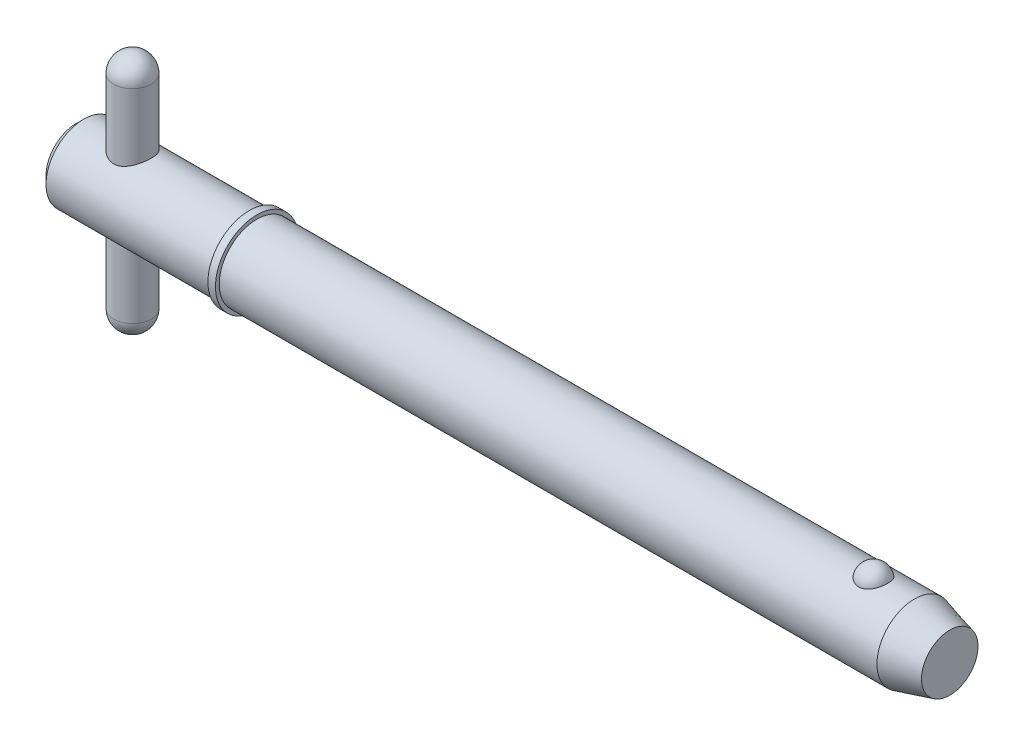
ISO-10303-21;
HEADER;
FILE_DESCRIPTION(('STEP AP214'),'2;1');
FILE_NAME('part.step','',(''),(''),'','','');
FILE_SCHEMA(('AUTOMOTIVE_DESIGN { 1 0 10303 214 1 1 1 1 }'));
ENDSEC;
DATA;
#1=APPLICATION_CONTEXT('core data for automotive mechanical design processes');
#2=APPLICATION_PROTOCOL_DEFINITION('international standard','automotive_design',2000,#1);
#3=PRODUCT_CONTEXT('',#1,'mechanical');
#4=PRODUCT('Part','Part','',(#3));
#5=PRODUCT_RELATED_PRODUCT_CATEGORY('part','',(#4));
#6=PRODUCT_DEFINITION_FORMATION('','',#4);
#7=PRODUCT_DEFINITION_CONTEXT('part definition',#1,'design');
#8=PRODUCT_DEFINITION('design','',#6,#7);
#9=PRODUCT_DEFINITION_SHAPE('','',#8);
#10=(LENGTH_UNIT() NAMED_UNIT(*) SI_UNIT(.MILLI.,.METRE.));
#11=(NAMED_UNIT(*) PLANE_ANGLE_UNIT() SI_UNIT($,.RADIAN.));
#12=(NAMED_UNIT(*) SI_UNIT($,.STERADIAN.) SOLID_ANGLE_UNIT());
#13=UNCERTAINTY_MEASURE_WITH_UNIT(LENGTH_MEASURE(1.E-05),#10,'distance_accuracy_value','');
#14=(GEOMETRIC_REPRESENTATION_CONTEXT(3) GLOBAL_UNCERTAINTY_ASSIGNED_CONTEXT((#13)) GLOBAL_UNIT_ASSIGNED_CONTEXT((#10,
#11,#12)) REPRESENTATION_CONTEXT('',''));
#15=CARTESIAN_POINT('',(0.,0.,0.));
#16=DIRECTION('',(0.,0.,1.));
#17=DIRECTION('',(1.,0.,0.));
#18=AXIS2_PLACEMENT_3D('',#15,#16,#17);
#19=CARTESIAN_POINT('',(5.94,12.7,0.));
#20=DIRECTION('',(0.,-1.,0.));
#21=DIRECTION('',(0.,0.,-1.));
#22=AXIS2_PLACEMENT_3D('',#19,#20,#21);
#23=CYLINDRICAL_SURFACE('',#22,1.98);
#24=CARTESIAN_POINT('',(5.94,-10.72,0.));
#25=DIRECTION('',(0.,-1.,0.));
#26=DIRECTION('',(0.,0.,-1.));
#27=AXIS2_PLACEMENT_3D('',#24,#25,#26);
#28=CIRCLE('',#27,1.98);
#29=CARTESIAN_POINT('',(5.94,-10.72,-1.98));
#30=VERTEX_POINT('',#29);
#31=EDGE_CURVE('P0_E10',#30,#30,#28,.F.);
#32=ORIENTED_EDGE('',*,*,#31,.T.);
#33=EDGE_LOOP('',(#32));
#34=FACE_BOUND('',#33,.T.);
#35=CARTESIAN_POINT('',(5.94,10.72,0.));
#36=DIRECTION('',(0.,-1.,0.));
#37=DIRECTION('',(0.,0.,-1.));
#38=AXIS2_PLACEMENT_3D('',#35,#36,#37);
#39=CIRCLE('',#38,1.98);
#40=CARTESIAN_POINT('',(5.94,10.72,-1.98));
#41=VERTEX_POINT('',#40);
#42=EDGE_CURVE('P0_E21',#41,#41,#39,.T.);
#43=ORIENTED_EDGE('',*,*,#42,.T.);
#44=EDGE_LOOP('',(#43));
#45=FACE_BOUND('',#44,.T.);
#46=ADVANCED_FACE('P0_F14',(#34,#45),#23,.T.);
#47=CARTESIAN_POINT('',(5.94,-10.72,0.));
#48=DIRECTION('',(0.,0.,1.));
#49=DIRECTION('',(1.,0.,0.));
#50=AXIS2_PLACEMENT_3D('',#47,#48,#49);
#51=SPHERICAL_SURFACE('',#50,1.98);
#52=CARTESIAN_POINT('',(5.94,-10.72,0.));
#53=DIRECTION('',(0.,-1.,0.));
#54=DIRECTION('',(0.,0.,-1.));
#55=AXIS2_PLACEMENT_3D('',#52,#53,#54);
#56=SPHERICAL_SURFACE('',#55,1.98);
#57=ORIENTED_EDGE('',*,*,#31,.F.);
#58=EDGE_LOOP('',(#57));
#59=FACE_BOUND('',#58,.T.);
#60=ADVANCED_FACE('P0_F29',(#59),#56,.T.);
#61=CARTESIAN_POINT('',(5.94,10.72,0.));
#62=DIRECTION('',(0.,0.,1.));
#63=DIRECTION('',(1.,0.,0.));
#64=AXIS2_PLACEMENT_3D('',#61,#62,#63);
#65=SPHERICAL_SURFACE('',#64,1.98);
#66=CARTESIAN_POINT('',(5.94,10.72,0.));
#67=DIRECTION('',(0.,-1.,0.));
#68=DIRECTION('',(0.,0.,-1.));
#69=AXIS2_PLACEMENT_3D('',#66,#67,#68);
#70=SPHERICAL_SURFACE('',#69,1.98);
#71=ORIENTED_EDGE('',*,*,#42,.F.);
#72=EDGE_LOOP('',(#71));
#73=FACE_BOUND('',#72,.T.);
#74=ADVANCED_FACE('P0_F16',(#73),#70,.T.);
#75=CLOSED_SHELL('',(#46,#60,#74));
#76=MANIFOLD_SOLID_BREP('P0_B1',#75);
#77=CARTESIAN_POINT('',(0.,0.,0.));
#78=DIRECTION('',(1.,0.,0.));
#79=DIRECTION('',(0.,0.,-1.));
#80=AXIS2_PLACEMENT_3D('',#77,#78,#79);
#81=CYLINDRICAL_SURFACE('',#80,3.97);
#82=CARTESIAN_POINT('',(88.3759395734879,0.,0.));
#83=DIRECTION('',(1.,0.,0.));
#84=DIRECTION('',(0.,0.,-1.));
#85=AXIS2_PLACEMENT_3D('',#82,#83,#84);
#86=CIRCLE('',#85,3.97);
#87=CARTESIAN_POINT('',(88.3759395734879,0.,-3.97));
#88=VERTEX_POINT('',#87);
#89=EDGE_CURVE('P1_E81',#88,#88,#86,.T.);
#90=ORIENTED_EDGE('',*,*,#89,.F.);
#91=EDGE_LOOP('',(#90));
#92=FACE_BOUND('',#91,.T.);
#93=CARTESIAN_POINT('',(19.05,0.,0.));
#94=DIRECTION('',(1.,0.,0.));
#95=DIRECTION('',(0.,0.,-1.));
#96=AXIS2_PLACEMENT_3D('',#93,#94,#95);
#97=CIRCLE('',#96,3.97);
#98=CARTESIAN_POINT('',(19.05,0.,-3.97));
#99=VERTEX_POINT('',#98);
#100=EDGE_CURVE('P1_E85',#99,#99,#97,.T.);
#101=ORIENTED_EDGE('',*,*,#100,.T.);
#102=EDGE_LOOP('',(#101));
#103=FACE_BOUND('',#102,.T.);
#104=CARTESIAN_POINT('',(84.0451922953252,3.65715365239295,1.54470941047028));
#105=CARTESIAN_POINT('',(83.9652448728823,3.65716001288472,1.54470290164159));
#106=CARTESIAN_POINT('',(83.8851650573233,3.65987074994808,1.53832549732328));
#107=CARTESIAN_POINT('',(83.7272374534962,3.6704221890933,1.51297018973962));
#108=CARTESIAN_POINT('',(83.6493961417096,3.67827646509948,1.49395894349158));
#109=CARTESIAN_POINT('',(83.4984614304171,3.69818848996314,1.44395950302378));
#110=CARTESIAN_POINT('',(83.4253560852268,3.71023513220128,1.41300293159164));
#111=CARTESIAN_POINT('',(83.2855630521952,3.73721833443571,1.34000212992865));
#112=CARTESIAN_POINT('',(83.2188725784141,3.75215363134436,1.2979627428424));
#113=CARTESIAN_POINT('',(83.0914886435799,3.78384968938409,1.20248834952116));
#114=CARTESIAN_POINT('',(83.0310299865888,3.80065129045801,1.14875388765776));
#115=CARTESIAN_POINT('',(82.9196942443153,3.83398532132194,1.03205417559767));
#116=CARTESIAN_POINT('',(82.8688200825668,3.85051766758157,0.969086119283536));
#117=CARTESIAN_POINT('',(82.7756321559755,3.88238608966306,0.832526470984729));
#118=CARTESIAN_POINT('',(82.7337961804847,3.89763698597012,0.758588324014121));
#119=CARTESIAN_POINT('',(82.6625108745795,3.92451063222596,0.60435211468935));
#120=CARTESIAN_POINT('',(82.6330623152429,3.93613315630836,0.524053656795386));
#121=CARTESIAN_POINT('',(82.5868927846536,3.95467606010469,0.358403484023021));
#122=CARTESIAN_POINT('',(82.5703127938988,3.96154426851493,0.273006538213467));
#123=CARTESIAN_POINT('',(82.550756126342,3.96967008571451,0.100408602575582));
#124=CARTESIAN_POINT('',(82.5477789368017,3.97092790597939,0.0132076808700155));
#125=CARTESIAN_POINT('',(82.5554587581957,3.96771794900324,-0.159844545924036));
#126=CARTESIAN_POINT('',(82.5660164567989,3.96329187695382,-0.245701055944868));
#127=CARTESIAN_POINT('',(82.6003800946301,3.94923163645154,-0.41427746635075));
#128=CARTESIAN_POINT('',(82.6241862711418,3.93959737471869,-0.496997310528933));
#129=CARTESIAN_POINT('',(82.6846114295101,3.91607752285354,-0.657113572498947));
#130=CARTESIAN_POINT('',(82.7212495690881,3.90218558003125,-0.734501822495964));
#131=CARTESIAN_POINT('',(82.8065935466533,3.87158287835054,-0.881704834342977));
#132=CARTESIAN_POINT('',(82.8553004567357,3.8548718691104,-0.951518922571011));
#133=CARTESIAN_POINT('',(82.9641161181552,3.82028735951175,-1.08208159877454));
#134=CARTESIAN_POINT('',(83.0242955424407,3.80240713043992,-1.14276958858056));
#135=CARTESIAN_POINT('',(83.154493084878,3.76758161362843,-1.2528243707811));
#136=CARTESIAN_POINT('',(83.2245105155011,3.75063626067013,-1.30219195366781));
#137=CARTESIAN_POINT('',(83.37118160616,3.71998948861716,-1.38729709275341));
#138=CARTESIAN_POINT('',(83.4476813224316,3.70623183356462,-1.42327904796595));
#139=CARTESIAN_POINT('',(83.6062981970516,3.68323188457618,-1.48178996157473));
#140=CARTESIAN_POINT('',(83.6884132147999,3.67398788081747,-1.5043240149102));
#141=CARTESIAN_POINT('',(83.8514810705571,3.6615216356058,-1.53440939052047));
#142=CARTESIAN_POINT('',(83.9322840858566,3.65801951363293,-1.54265826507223));
#143=CARTESIAN_POINT('',(84.0942085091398,3.65657341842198,-1.54608423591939));
#144=CARTESIAN_POINT('',(84.1753298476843,3.65862829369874,-1.54126404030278));
#145=CARTESIAN_POINT('',(84.3328122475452,3.66788969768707,-1.51908474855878));
#146=CARTESIAN_POINT('',(84.4092422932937,3.67492621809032,-1.50213925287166));
#147=CARTESIAN_POINT('',(84.5580412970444,3.69318404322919,-1.45666982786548));
#148=CARTESIAN_POINT('',(84.6304099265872,3.70440568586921,-1.42814496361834));
#149=CARTESIAN_POINT('',(84.7708029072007,3.73012749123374,-1.35956319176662));
#150=CARTESIAN_POINT('',(84.8387000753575,3.74469307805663,-1.31927107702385));
#151=CARTESIAN_POINT('',(84.9668649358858,3.77545272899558,-1.22847440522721));
#152=CARTESIAN_POINT('',(85.0271308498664,3.79164717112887,-1.17796747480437));
#153=CARTESIAN_POINT('',(85.1416346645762,3.82490325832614,-1.06519260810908));
#154=CARTESIAN_POINT('',(85.1954137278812,3.84196735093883,-1.00245914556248));
#155=CARTESIAN_POINT('',(85.2920988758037,3.87439863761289,-0.868715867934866));
#156=CARTESIAN_POINT('',(85.3350030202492,3.88976552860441,-0.797704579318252));
#157=CARTESIAN_POINT('',(85.410266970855,3.91771381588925,-0.646896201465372));
#158=CARTESIAN_POINT('',(85.4422532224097,3.93019255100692,-0.566893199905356));
#159=CARTESIAN_POINT('',(85.4931101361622,3.95043886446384,-0.402255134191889));
#160=CARTESIAN_POINT('',(85.5119807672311,3.95820643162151,-0.317620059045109));
#161=CARTESIAN_POINT('',(85.5362162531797,3.96823733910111,-0.146156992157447));
#162=CARTESIAN_POINT('',(85.5415874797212,3.970503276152,-0.0593300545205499));
#163=CARTESIAN_POINT('',(85.5387309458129,3.96930811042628,0.114057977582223));
#164=CARTESIAN_POINT('',(85.530503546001,3.9658471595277,0.200619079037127));
#165=CARTESIAN_POINT('',(85.5007063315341,3.95358562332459,0.370506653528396));
#166=CARTESIAN_POINT('',(85.4792129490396,3.94481563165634,0.453848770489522));
#167=CARTESIAN_POINT('',(85.4233839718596,3.92284586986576,0.615497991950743));
#168=CARTESIAN_POINT('',(85.3890474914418,3.90964579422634,0.693804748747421));
#169=CARTESIAN_POINT('',(85.3079702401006,3.88006987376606,0.843703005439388));
#170=CARTESIAN_POINT('',(85.2611536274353,3.86367478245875,0.915249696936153));
#171=CARTESIAN_POINT('',(85.1561897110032,3.82949741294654,1.04910810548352));
#172=CARTESIAN_POINT('',(85.0980428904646,3.81171519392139,1.11142021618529));
#173=CARTESIAN_POINT('',(84.9717433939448,3.77673366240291,1.22503948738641));
#174=CARTESIAN_POINT('',(84.9035970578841,3.75953398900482,1.27635357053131));
#175=CARTESIAN_POINT('',(84.7589009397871,3.72770506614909,1.36653336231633));
#176=CARTESIAN_POINT('',(84.682348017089,3.71307678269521,1.40539439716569));
#177=CARTESIAN_POINT('',(84.5257594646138,3.68864287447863,1.46830480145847));
#178=CARTESIAN_POINT('',(84.4459307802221,3.67869017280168,1.49281289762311));
#179=CARTESIAN_POINT('',(84.2829877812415,3.66414535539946,1.52817474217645));
#180=CARTESIAN_POINT('',(84.1998840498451,3.65953723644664,1.53906926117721));
#181=CARTESIAN_POINT('',(84.0927760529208,3.6573894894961,1.54414878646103));
#182=CARTESIAN_POINT('',(84.0689900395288,3.65715175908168,1.54471134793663));
#183=CARTESIAN_POINT('',(84.0451922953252,3.65715365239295,1.54470941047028));
#184=B_SPLINE_CURVE_WITH_KNOTS('',3,(#104,#105,#106,#107,#108,#109,#110,#111,#112,#113,#114,
#115,#116,#117,#118,#119,#120,#121,#122,#123,#124,#125,#126,#127,#128,#129,#130,#131,#132,#133,
#134,#135,#136,#137,#138,#139,#140,#141,#142,#143,#144,#145,#146,#147,#148,#149,#150,#151,#152,
#153,#154,#155,#156,#157,#158,#159,#160,#161,#162,#163,#164,#165,#166,#167,#168,#169,#170,#171,
#172,#173,#174,#175,#176,#177,#178,#179,#180,#181,#182,#183),.UNSPECIFIED.,.T.,.F.,(4,2,2,2,2,2,
2,2,2,2,2,2,2,2,2,2,2,2,2,2,2,2,2,2,2,2,2,2,2,2,2,2,2,2,2,2,2,2,2,4),(0.,0.239777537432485,
0.480190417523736,0.719971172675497,0.959647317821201,1.20639040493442,1.45320863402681,
1.7109367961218,1.96868099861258,2.22921052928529,2.48973023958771,2.74834928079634,
3.00697295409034,3.26598440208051,3.52501886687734,3.78570385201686,4.04637062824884,
4.30201257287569,4.5575576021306,4.80022994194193,5.04285200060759,5.27757006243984,
5.51230707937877,5.75210128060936,5.99195126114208,6.24392810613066,6.49594987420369,
6.75588818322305,7.01582710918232,7.27564332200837,7.53545264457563,7.79377886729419,
8.0521229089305,8.31207418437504,8.57201437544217,8.83179046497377,9.09166393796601,
9.34270057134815,9.59298357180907,9.66435753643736),.UNSPECIFIED.);
#185=CARTESIAN_POINT('',(84.0451922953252,3.65715365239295,1.54470941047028));
#186=VERTEX_POINT('',#185);
#187=EDGE_CURVE('P1_E35',#186,#186,#184,.T.);
#188=ORIENTED_EDGE('',*,*,#187,.T.);
#189=EDGE_LOOP('',(#188));
#190=FACE_BOUND('',#189,.T.);
#191=ADVANCED_FACE('P1_F13',(#92,#103,#190),#81,.T.);
#192=CARTESIAN_POINT('',(0.,0.,0.));
#193=DIRECTION('',(-1.,0.,0.));
#194=DIRECTION('',(0.,0.,1.));
#195=AXIS2_PLACEMENT_3D('',#192,#193,#194);
#196=PLANE('',#195);
#197=CARTESIAN_POINT('',(0.,0.,0.));
#198=DIRECTION('',(1.,0.,0.));
#199=DIRECTION('',(0.,0.,-1.));
#200=AXIS2_PLACEMENT_3D('',#197,#198,#199);
#201=CIRCLE('',#200,3.176);
#202=CARTESIAN_POINT('',(0.,0.,-3.176));
#203=VERTEX_POINT('',#202);
#204=EDGE_CURVE('P1_E9',#203,#203,#201,.T.);
#205=ORIENTED_EDGE('',*,*,#204,.F.);
#206=EDGE_LOOP('',(#205));
#207=FACE_BOUND('',#206,.T.);
#208=ADVANCED_FACE('P1_F15',(#207),#196,.T.);
#209=CARTESIAN_POINT('',(0.793999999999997,0.,0.));
#210=DIRECTION('',(1.,0.,0.));
#211=DIRECTION('',(0.,0.,-1.));
#212=AXIS2_PLACEMENT_3D('',#209,#210,#211);
#213=CONICAL_SURFACE('',#212,3.97,0.78539816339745);
#214=ORIENTED_EDGE('',*,*,#204,.T.);
#215=EDGE_LOOP('',(#214));
#216=FACE_BOUND('',#215,.T.);
#217=CARTESIAN_POINT('',(0.793999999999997,0.,0.));
#218=DIRECTION('',(1.,0.,0.));
#219=DIRECTION('',(0.,0.,-1.));
#220=AXIS2_PLACEMENT_3D('',#217,#218,#219);
#221=CIRCLE('',#220,3.97);
#222=CARTESIAN_POINT('',(0.793999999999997,0.,-3.97));
#223=VERTEX_POINT('',#222);
#224=EDGE_CURVE('P1_E26',#223,#223,#221,.T.);
#225=ORIENTED_EDGE('',*,*,#224,.F.);
#226=EDGE_LOOP('',(#225));
#227=FACE_BOUND('',#226,.T.);
#228=ADVANCED_FACE('P1_F77',(#216,#227),#213,.T.);
#229=CARTESIAN_POINT('',(0.,0.,0.));
#230=DIRECTION('',(1.,0.,0.));
#231=DIRECTION('',(0.,0.,-1.));
#232=AXIS2_PLACEMENT_3D('',#229,#230,#231);
#233=CYLINDRICAL_SURFACE('',#232,3.97);
#234=CARTESIAN_POINT('',(5.94,-3.44100276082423,1.98));
#235=CARTESIAN_POINT('',(5.8367885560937,-3.44101282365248,1.97999171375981));
#236=CARTESIAN_POINT('',(5.73344176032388,-3.44571749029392,1.97187534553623));
#237=CARTESIAN_POINT('',(5.52991905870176,-3.46385873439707,1.93981946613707));
#238=CARTESIAN_POINT('',(5.42975031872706,-3.47731375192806,1.91584653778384));
#239=CARTESIAN_POINT('',(5.23590869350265,-3.51100678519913,1.85336773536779));
#240=CARTESIAN_POINT('',(5.14220446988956,-3.53120882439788,1.81493880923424));
#241=CARTESIAN_POINT('',(4.9625969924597,-3.57606420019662,1.72487335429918));
#242=CARTESIAN_POINT('',(4.87669412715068,-3.6007177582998,1.67323616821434));
#243=CARTESIAN_POINT('',(4.70734412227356,-3.65417020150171,1.55325205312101));
#244=CARTESIAN_POINT('',(4.62467662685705,-3.68314323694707,1.4838818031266));
#245=CARTESIAN_POINT('',(4.47154355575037,-3.74056406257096,1.33252902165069));
#246=CARTESIAN_POINT('',(4.40108404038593,-3.76901158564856,1.25054026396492));
#247=CARTESIAN_POINT('',(4.26974803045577,-3.82445556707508,1.06956584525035));
#248=CARTESIAN_POINT('',(4.20982960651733,-3.8512271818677,0.969809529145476));
#249=CARTESIAN_POINT('',(4.10798077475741,-3.89804342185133,0.760047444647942));
#250=CARTESIAN_POINT('',(4.06603907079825,-3.91809226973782,0.650048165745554));
#251=CARTESIAN_POINT('',(4.00441878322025,-3.94794912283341,0.431181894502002));
#252=CARTESIAN_POINT('',(3.98337329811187,-3.95838209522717,0.322786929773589));
#253=CARTESIAN_POINT('',(3.9596425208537,-3.97016407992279,0.103541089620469));
#254=CARTESIAN_POINT('',(3.95694618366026,-3.97151855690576,-0.00730826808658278));
#255=CARTESIAN_POINT('',(3.9694599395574,-3.96528826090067,-0.218044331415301));
#256=CARTESIAN_POINT('',(3.98314071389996,-3.95846689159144,-0.318049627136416));
#257=CARTESIAN_POINT('',(4.02528522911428,-3.93780347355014,-0.514124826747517));
#258=CARTESIAN_POINT('',(4.05375007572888,-3.92396089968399,-0.61019443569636));
#259=CARTESIAN_POINT('',(4.12484256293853,-3.89028355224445,-0.797351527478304));
#260=CARTESIAN_POINT('',(4.16766142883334,-3.87036821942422,-0.888351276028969));
#261=CARTESIAN_POINT('',(4.26598377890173,-3.82634285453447,-1.06209448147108));
#262=CARTESIAN_POINT('',(4.32149181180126,-3.8022313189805,-1.14483496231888));
#263=CARTESIAN_POINT('',(4.44962332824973,-3.74940011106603,-1.30802500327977));
#264=CARTESIAN_POINT('',(4.52336636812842,-3.72046031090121,-1.38752498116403));
#265=CARTESIAN_POINT('',(4.68287656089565,-3.66269463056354,-1.53354043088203));
#266=CARTESIAN_POINT('',(4.7686527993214,-3.63386885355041,-1.60004599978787));
#267=CARTESIAN_POINT('',(4.9564069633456,-3.57763161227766,-1.72228426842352));
#268=CARTESIAN_POINT('',(5.05906485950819,-3.5504233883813,-1.77707534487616));
#269=CARTESIAN_POINT('',(5.27381412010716,-3.50334038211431,-1.86819784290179));
#270=CARTESIAN_POINT('',(5.38589553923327,-3.48345798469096,-1.90454844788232));
#271=CARTESIAN_POINT('',(5.6069795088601,-3.45548331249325,-1.95481643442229));
#272=CARTESIAN_POINT('',(5.71552407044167,-3.44658268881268,-1.97028113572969));
#273=CARTESIAN_POINT('',(5.93399639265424,-3.43928114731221,-1.98300600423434));
#274=CARTESIAN_POINT('',(6.04392313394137,-3.44087289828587,-1.98027888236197));
#275=CARTESIAN_POINT('',(6.24931618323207,-3.45351901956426,-1.95811780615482));
#276=CARTESIAN_POINT('',(6.34505668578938,-3.46352725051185,-1.94052989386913));
#277=CARTESIAN_POINT('',(6.53204702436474,-3.49033612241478,-1.89188242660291));
#278=CARTESIAN_POINT('',(6.62329540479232,-3.50713894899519,-1.86081853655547));
#279=CARTESIAN_POINT('',(6.80352105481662,-3.54655680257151,-1.78458666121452));
#280=CARTESIAN_POINT('',(6.89219712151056,-3.56940508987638,-1.73883178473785));
#281=CARTESIAN_POINT('',(7.06112449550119,-3.61813012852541,-1.63502913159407));
#282=CARTESIAN_POINT('',(7.14137144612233,-3.6440084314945,-1.57697504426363));
#283=CARTESIAN_POINT('',(7.30168083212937,-3.69977514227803,-1.44171920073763));
#284=CARTESIAN_POINT('',(7.38046039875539,-3.7297597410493,-1.36302972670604));
#285=CARTESIAN_POINT('',(7.52409649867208,-3.78754991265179,-1.19307190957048));
#286=CARTESIAN_POINT('',(7.58894840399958,-3.81535475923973,-1.10179940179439));
#287=CARTESIAN_POINT('',(7.70430122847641,-3.86658972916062,-0.906019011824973));
#288=CARTESIAN_POINT('',(7.75438714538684,-3.88988795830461,-0.801229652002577));
#289=CARTESIAN_POINT('',(7.83572184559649,-3.92848199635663,-0.583216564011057));
#290=CARTESIAN_POINT('',(7.86698708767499,-3.94378479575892,-0.470000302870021));
#291=CARTESIAN_POINT('',(7.90711051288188,-3.96355307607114,-0.249525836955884));
#292=CARTESIAN_POINT('',(7.91775648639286,-3.96888171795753,-0.142669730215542));
#293=CARTESIAN_POINT('',(7.92160247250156,-3.97079858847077,0.0714191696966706));
#294=CARTESIAN_POINT('',(7.91480852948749,-3.96738984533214,0.178651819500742));
#295=CARTESIAN_POINT('',(7.88515479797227,-3.9527181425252,0.383072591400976));
#296=CARTESIAN_POINT('',(7.8633739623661,-3.94198303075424,0.480459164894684));
#297=CARTESIAN_POINT('',(7.80581513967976,-3.91422178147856,0.670038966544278));
#298=CARTESIAN_POINT('',(7.77003513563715,-3.89719473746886,0.762231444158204));
#299=CARTESIAN_POINT('',(7.68389191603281,-3.85747818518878,0.943248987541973));
#300=CARTESIAN_POINT('',(7.63296879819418,-3.83457704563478,1.03175978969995));
#301=CARTESIAN_POINT('',(7.51869140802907,-3.7855122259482,1.19934744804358));
#302=CARTESIAN_POINT('',(7.45533142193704,-3.75934704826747,1.2784199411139));
#303=CARTESIAN_POINT('',(7.31068939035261,-3.70329841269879,1.433144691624));
#304=CARTESIAN_POINT('',(7.22825362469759,-3.67330340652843,1.50768183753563));
#305=CARTESIAN_POINT('',(7.05162367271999,-3.61514025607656,1.64226879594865));
#306=CARTESIAN_POINT('',(6.95741928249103,-3.58697372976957,1.70230590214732));
#307=CARTESIAN_POINT('',(6.75590859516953,-3.53504049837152,1.80775364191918));
#308=CARTESIAN_POINT('',(6.64828786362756,-3.51143624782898,1.85265616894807));
#309=CARTESIAN_POINT('',(6.48137774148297,-3.48289659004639,1.90544537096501));
#310=CARTESIAN_POINT('',(6.42488151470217,-3.4745323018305,1.9206071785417));
#311=CARTESIAN_POINT('',(6.31046920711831,-3.4604244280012,1.94591259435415));
#312=CARTESIAN_POINT('',(6.25255415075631,-3.45467900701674,1.95605971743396));
#313=CARTESIAN_POINT('',(6.1521444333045,-3.44728060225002,1.96905939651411));
#314=CARTESIAN_POINT('',(6.10985721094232,-3.44493297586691,1.97315742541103));
#315=CARTESIAN_POINT('',(6.02505433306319,-3.44179192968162,1.97862952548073));
#316=CARTESIAN_POINT('',(5.98253866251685,-3.44099861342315,1.98000341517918));
#317=CARTESIAN_POINT('',(5.94,-3.44100276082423,1.98));
#318=B_SPLINE_CURVE_WITH_KNOTS('',3,(#234,#235,#236,#237,#238,#239,#240,#241,#242,#243,#244,
#245,#246,#247,#248,#249,#250,#251,#252,#253,#254,#255,#256,#257,#258,#259,#260,#261,#262,#263,
#264,#265,#266,#267,#268,#269,#270,#271,#272,#273,#274,#275,#276,#277,#278,#279,#280,#281,#282,
#283,#284,#285,#286,#287,#288,#289,#290,#291,#292,#293,#294,#295,#296,#297,#298,#299,#300,#301,
#302,#303,#304,#305,#306,#307,#308,#309,#310,#311,#312,#313,#314,#315,#316,#317),.UNSPECIFIED.,
.T.,.F.,(4,2,2,2,2,2,2,2,2,2,2,2,2,2,2,2,2,2,2,2,2,2,2,2,2,2,2,2,2,2,2,2,2,2,2,2,2,2,2,2,2,4),
(0.,0.309462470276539,0.619579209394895,0.928068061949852,1.23657226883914,1.57038619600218,
1.90436536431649,2.26071614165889,2.61684266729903,2.94773555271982,3.27842924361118,
3.58050679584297,3.88260694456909,4.18890317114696,4.49530936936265,4.83057163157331,
5.1660884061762,5.52272472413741,5.87898927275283,6.20706708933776,6.53491569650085,
6.82716910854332,7.11951660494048,7.42541184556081,7.73146442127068,8.07586334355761,
8.42037652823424,8.77380887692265,9.12693169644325,9.44775848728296,9.76847409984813,
10.0682302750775,10.3680296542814,10.6806938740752,10.9935020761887,11.3373031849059,
11.6814044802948,12.0361164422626,12.2131519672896,12.3900632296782,12.5175998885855,
12.6451450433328),.UNSPECIFIED.);
#319=CARTESIAN_POINT('',(5.94,-3.44100276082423,1.98));
#320=VERTEX_POINT('',#319);
#321=EDGE_CURVE('P1_E17',#320,#320,#318,.T.);
#322=ORIENTED_EDGE('',*,*,#321,.F.);
#323=EDGE_LOOP('',(#322));
#324=FACE_BOUND('',#323,.T.);
#325=CARTESIAN_POINT('',(5.94,3.44100276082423,1.98));
#326=CARTESIAN_POINT('',(6.0432114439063,3.44101282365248,1.97999171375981));
#327=CARTESIAN_POINT('',(6.14655823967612,3.44571749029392,1.97187534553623));
#328=CARTESIAN_POINT('',(6.35008094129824,3.46385873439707,1.93981946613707));
#329=CARTESIAN_POINT('',(6.45024968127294,3.47731375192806,1.91584653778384));
#330=CARTESIAN_POINT('',(6.64409130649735,3.51100678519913,1.85336773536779));
#331=CARTESIAN_POINT('',(6.73779553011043,3.53120882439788,1.81493880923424));
#332=CARTESIAN_POINT('',(6.91740300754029,3.57606420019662,1.72487335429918));
#333=CARTESIAN_POINT('',(7.00330587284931,3.6007177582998,1.67323616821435));
#334=CARTESIAN_POINT('',(7.17265587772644,3.65417020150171,1.55325205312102));
#335=CARTESIAN_POINT('',(7.25532337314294,3.68314323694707,1.4838818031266));
#336=CARTESIAN_POINT('',(7.40845644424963,3.74056406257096,1.3325290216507));
#337=CARTESIAN_POINT('',(7.47891595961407,3.76901158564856,1.25054026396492));
#338=CARTESIAN_POINT('',(7.61025196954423,3.82445556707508,1.06956584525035));
#339=CARTESIAN_POINT('',(7.67017039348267,3.8512271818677,0.969809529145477));
#340=CARTESIAN_POINT('',(7.77201922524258,3.89804342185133,0.760047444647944));
#341=CARTESIAN_POINT('',(7.81396092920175,3.91809226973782,0.650048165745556));
#342=CARTESIAN_POINT('',(7.87558121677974,3.94794912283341,0.431181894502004));
#343=CARTESIAN_POINT('',(7.89662670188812,3.95838209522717,0.322786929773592));
#344=CARTESIAN_POINT('',(7.9203574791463,3.97016407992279,0.103541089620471));
#345=CARTESIAN_POINT('',(7.92305381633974,3.97151855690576,-0.00730826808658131));
#346=CARTESIAN_POINT('',(7.9105400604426,3.96528826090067,-0.2180443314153));
#347=CARTESIAN_POINT('',(7.89685928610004,3.95846689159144,-0.318049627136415));
#348=CARTESIAN_POINT('',(7.85471477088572,3.93780347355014,-0.514124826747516));
#349=CARTESIAN_POINT('',(7.82624992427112,3.92396089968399,-0.61019443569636));
#350=CARTESIAN_POINT('',(7.75515743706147,3.89028355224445,-0.797351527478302));
#351=CARTESIAN_POINT('',(7.71233857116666,3.87036821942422,-0.888351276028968));
#352=CARTESIAN_POINT('',(7.61401622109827,3.82634285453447,-1.06209448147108));
#353=CARTESIAN_POINT('',(7.55850818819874,3.8022313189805,-1.14483496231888));
#354=CARTESIAN_POINT('',(7.43037667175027,3.74940011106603,-1.30802500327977));
#355=CARTESIAN_POINT('',(7.35663363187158,3.72046031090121,-1.38752498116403));
#356=CARTESIAN_POINT('',(7.19712343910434,3.66269463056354,-1.53354043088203));
#357=CARTESIAN_POINT('',(7.1113472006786,3.63386885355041,-1.60004599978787));
#358=CARTESIAN_POINT('',(6.9235930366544,3.57763161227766,-1.72228426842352));
#359=CARTESIAN_POINT('',(6.82093514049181,3.5504233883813,-1.77707534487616));
#360=CARTESIAN_POINT('',(6.60618587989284,3.50334038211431,-1.86819784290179));
#361=CARTESIAN_POINT('',(6.49410446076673,3.48345798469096,-1.90454844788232));
#362=CARTESIAN_POINT('',(6.2730204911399,3.45548331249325,-1.95481643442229));
#363=CARTESIAN_POINT('',(6.16447592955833,3.44658268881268,-1.97028113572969));
#364=CARTESIAN_POINT('',(5.94600360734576,3.43928114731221,-1.98300600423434));
#365=CARTESIAN_POINT('',(5.83607686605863,3.44087289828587,-1.98027888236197));
#366=CARTESIAN_POINT('',(5.63068381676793,3.45351901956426,-1.95811780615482));
#367=CARTESIAN_POINT('',(5.53494331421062,3.46352725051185,-1.94052989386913));
#368=CARTESIAN_POINT('',(5.34795297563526,3.49033612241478,-1.89188242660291));
#369=CARTESIAN_POINT('',(5.25670459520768,3.50713894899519,-1.86081853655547));
#370=CARTESIAN_POINT('',(5.07647894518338,3.54655680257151,-1.78458666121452));
#371=CARTESIAN_POINT('',(4.98780287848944,3.56940508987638,-1.73883178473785));
#372=CARTESIAN_POINT('',(4.81887550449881,3.61813012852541,-1.63502913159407));
#373=CARTESIAN_POINT('',(4.73862855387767,3.6440084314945,-1.57697504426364));
#374=CARTESIAN_POINT('',(4.57831916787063,3.69977514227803,-1.44171920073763));
#375=CARTESIAN_POINT('',(4.49953960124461,3.7297597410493,-1.36302972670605));
#376=CARTESIAN_POINT('',(4.35590350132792,3.78754991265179,-1.19307190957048));
#377=CARTESIAN_POINT('',(4.29105159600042,3.81535475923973,-1.10179940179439));
#378=CARTESIAN_POINT('',(4.17569877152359,3.86658972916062,-0.906019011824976));
#379=CARTESIAN_POINT('',(4.12561285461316,3.88988795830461,-0.80122965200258));
#380=CARTESIAN_POINT('',(4.04427815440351,3.92848199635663,-0.58321656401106));
#381=CARTESIAN_POINT('',(4.01301291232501,3.94378479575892,-0.470000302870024));
#382=CARTESIAN_POINT('',(3.97288948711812,3.96355307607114,-0.249525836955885));
#383=CARTESIAN_POINT('',(3.96224351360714,3.96888171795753,-0.142669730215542));
#384=CARTESIAN_POINT('',(3.95839752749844,3.97079858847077,0.0714191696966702));
#385=CARTESIAN_POINT('',(3.96519147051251,3.96738984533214,0.178651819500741));
#386=CARTESIAN_POINT('',(3.99484520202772,3.9527181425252,0.383072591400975));
#387=CARTESIAN_POINT('',(4.01662603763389,3.94198303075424,0.480459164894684));
#388=CARTESIAN_POINT('',(4.07418486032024,3.91422178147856,0.670038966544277));
#389=CARTESIAN_POINT('',(4.10996486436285,3.89719473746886,0.762231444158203));
#390=CARTESIAN_POINT('',(4.19610808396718,3.85747818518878,0.943248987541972));
#391=CARTESIAN_POINT('',(4.24703120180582,3.83457704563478,1.03175978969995));
#392=CARTESIAN_POINT('',(4.36130859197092,3.7855122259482,1.19934744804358));
#393=CARTESIAN_POINT('',(4.42466857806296,3.75934704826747,1.2784199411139));
#394=CARTESIAN_POINT('',(4.56931060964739,3.70329841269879,1.433144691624));
#395=CARTESIAN_POINT('',(4.65174637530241,3.67330340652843,1.50768183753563));
#396=CARTESIAN_POINT('',(4.82837632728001,3.61514025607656,1.64226879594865));
#397=CARTESIAN_POINT('',(4.92258071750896,3.58697372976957,1.70230590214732));
#398=CARTESIAN_POINT('',(5.12409140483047,3.53504049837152,1.80775364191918));
#399=CARTESIAN_POINT('',(5.23171213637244,3.51143624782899,1.85265616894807));
#400=CARTESIAN_POINT('',(5.39862225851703,3.48289659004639,1.90544537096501));
#401=CARTESIAN_POINT('',(5.45511848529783,3.4745323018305,1.9206071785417));
#402=CARTESIAN_POINT('',(5.56953079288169,3.4604244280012,1.94591259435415));
#403=CARTESIAN_POINT('',(5.62744584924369,3.45467900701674,1.95605971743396));
#404=CARTESIAN_POINT('',(5.7278555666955,3.44728060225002,1.9690593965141));
#405=CARTESIAN_POINT('',(5.77014278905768,3.44493297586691,1.97315742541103));
#406=CARTESIAN_POINT('',(5.85494566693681,3.44179192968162,1.97862952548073));
#407=CARTESIAN_POINT('',(5.89746133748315,3.44099861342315,1.98000341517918));
#408=CARTESIAN_POINT('',(5.94,3.44100276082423,1.98));
#409=B_SPLINE_CURVE_WITH_KNOTS('',3,(#325,#326,#327,#328,#329,#330,#331,#332,#333,#334,#335,
#336,#337,#338,#339,#340,#341,#342,#343,#344,#345,#346,#347,#348,#349,#350,#351,#352,#353,#354,
#355,#356,#357,#358,#359,#360,#361,#362,#363,#364,#365,#366,#367,#368,#369,#370,#371,#372,#373,
#374,#375,#376,#377,#378,#379,#380,#381,#382,#383,#384,#385,#386,#387,#388,#389,#390,#391,#392,
#393,#394,#395,#396,#397,#398,#399,#400,#401,#402,#403,#404,#405,#406,#407,#408),.UNSPECIFIED.,
.T.,.F.,(4,2,2,2,2,2,2,2,2,2,2,2,2,2,2,2,2,2,2,2,2,2,2,2,2,2,2,2,2,2,2,2,2,2,2,2,2,2,2,2,2,4),
(0.,0.309462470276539,0.619579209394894,0.928068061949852,1.23657226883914,1.57038619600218,
1.90436536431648,2.26071614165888,2.61684266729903,2.94773555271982,3.27842924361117,
3.58050679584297,3.88260694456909,4.18890317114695,4.49530936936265,4.83057163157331,
5.1660884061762,5.5227247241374,5.87898927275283,6.20706708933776,6.53491569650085,
6.82716910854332,7.11951660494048,7.42541184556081,7.73146442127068,8.07586334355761,
8.42037652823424,8.77380887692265,9.12693169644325,9.44775848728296,9.76847409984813,
10.0682302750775,10.3680296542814,10.6806938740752,10.9935020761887,11.3373031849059,
11.6814044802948,12.0361164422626,12.2131519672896,12.3900632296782,12.5175998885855,
12.6451450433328),.UNSPECIFIED.);
#410=CARTESIAN_POINT('',(5.94,3.44100276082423,1.98));
#411=VERTEX_POINT('',#410);
#412=EDGE_CURVE('P1_E43',#411,#411,#409,.T.);
#413=ORIENTED_EDGE('',*,*,#412,.F.);
#414=EDGE_LOOP('',(#413));
#415=FACE_BOUND('',#414,.T.);
#416=ORIENTED_EDGE('',*,*,#224,.T.);
#417=EDGE_LOOP('',(#416));
#418=FACE_BOUND('',#417,.T.);
#419=CARTESIAN_POINT('',(18.256,0.,0.));
#420=DIRECTION('',(1.,0.,0.));
#421=DIRECTION('',(0.,0.,-1.));
#422=AXIS2_PLACEMENT_3D('',#419,#420,#421);
#423=CIRCLE('',#422,3.97);
#424=CARTESIAN_POINT('',(18.256,0.,-3.97));
#425=VERTEX_POINT('',#424);
#426=EDGE_CURVE('P1_E31',#425,#425,#423,.T.);
#427=ORIENTED_EDGE('',*,*,#426,.F.);
#428=EDGE_LOOP('',(#427));
#429=FACE_BOUND('',#428,.T.);
#430=ADVANCED_FACE('P1_F103',(#324,#415,#418,#429),#233,.T.);
#431=CARTESIAN_POINT('',(18.256,3.97,0.));
#432=DIRECTION('',(-1.,0.,0.));
#433=DIRECTION('',(0.,0.,1.));
#434=AXIS2_PLACEMENT_3D('',#431,#432,#433);
#435=PLANE('',#434);
#436=ORIENTED_EDGE('',*,*,#426,.T.);
#437=EDGE_LOOP('',(#436));
#438=FACE_BOUND('',#437,.T.);
#439=CARTESIAN_POINT('',(18.256,0.,0.));
#440=DIRECTION('',(1.,0.,0.));
#441=DIRECTION('',(0.,0.,-1.));
#442=AXIS2_PLACEMENT_3D('',#439,#440,#441);
#443=CIRCLE('',#442,4.367);
#444=CARTESIAN_POINT('',(18.256,0.,-4.367));
#445=VERTEX_POINT('',#444);
#446=EDGE_CURVE('P1_E91',#445,#445,#443,.T.);
#447=ORIENTED_EDGE('',*,*,#446,.F.);
#448=EDGE_LOOP('',(#447));
#449=FACE_BOUND('',#448,.T.);
#450=ADVANCED_FACE('P1_F100',(#438,#449),#435,.T.);
#451=CARTESIAN_POINT('',(0.,0.,0.));
#452=DIRECTION('',(1.,0.,0.));
#453=DIRECTION('',(0.,0.,-1.));
#454=AXIS2_PLACEMENT_3D('',#451,#452,#453);
#455=CYLINDRICAL_SURFACE('',#454,4.367);
#456=ORIENTED_EDGE('',*,*,#446,.T.);
#457=EDGE_LOOP('',(#456));
#458=FACE_BOUND('',#457,.T.);
#459=CARTESIAN_POINT('',(19.05,0.,0.));
#460=DIRECTION('',(1.,0.,0.));
#461=DIRECTION('',(0.,0.,-1.));
#462=AXIS2_PLACEMENT_3D('',#459,#460,#461);
#463=CIRCLE('',#462,4.367);
#464=CARTESIAN_POINT('',(19.05,0.,-4.367));
#465=VERTEX_POINT('',#464);
#466=EDGE_CURVE('P1_E88',#465,#465,#463,.T.);
#467=ORIENTED_EDGE('',*,*,#466,.F.);
#468=EDGE_LOOP('',(#467));
#469=FACE_BOUND('',#468,.T.);
#470=ADVANCED_FACE('P1_F68',(#458,#469),#455,.T.);
#471=CARTESIAN_POINT('',(19.05,4.367,0.));
#472=DIRECTION('',(1.,0.,0.));
#473=DIRECTION('',(0.,0.,-1.));
#474=AXIS2_PLACEMENT_3D('',#471,#472,#473);
#475=PLANE('',#474);
#476=ORIENTED_EDGE('',*,*,#466,.T.);
#477=EDGE_LOOP('',(#476));
#478=FACE_BOUND('',#477,.T.);
#479=ORIENTED_EDGE('',*,*,#100,.F.);
#480=EDGE_LOOP('',(#479));
#481=FACE_BOUND('',#480,.T.);
#482=ADVANCED_FACE('P1_F62',(#478,#481),#475,.T.);
#483=CARTESIAN_POINT('',(92.08,0.,0.));
#484=DIRECTION('',(-1.,0.,0.));
#485=DIRECTION('',(0.,0.,1.));
#486=AXIS2_PLACEMENT_3D('',#483,#484,#485);
#487=CONICAL_SURFACE('',#486,2.97750000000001,0.261799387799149);
#488=ORIENTED_EDGE('',*,*,#89,.T.);
#489=EDGE_LOOP('',(#488));
#490=FACE_BOUND('',#489,.T.);
#491=CARTESIAN_POINT('',(92.08,0.,0.));
#492=DIRECTION('',(1.,0.,0.));
#493=DIRECTION('',(0.,0.,-1.));
#494=AXIS2_PLACEMENT_3D('',#491,#492,#493);
#495=CIRCLE('',#494,2.97750000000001);
#496=CARTESIAN_POINT('',(92.08,0.,-2.97750000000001));
#497=VERTEX_POINT('',#496);
#498=EDGE_CURVE('P1_E42',#497,#497,#495,.T.);
#499=ORIENTED_EDGE('',*,*,#498,.F.);
#500=EDGE_LOOP('',(#499));
#501=FACE_BOUND('',#500,.T.);
#502=ADVANCED_FACE('P1_F59',(#490,#501),#487,.T.);
#503=CARTESIAN_POINT('',(92.08,2.97750000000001,0.));
#504=DIRECTION('',(1.,0.,0.));
#505=DIRECTION('',(0.,0.,-1.));
#506=AXIS2_PLACEMENT_3D('',#503,#504,#505);
#507=PLANE('',#506);
#508=ORIENTED_EDGE('',*,*,#498,.T.);
#509=EDGE_LOOP('',(#508));
#510=FACE_BOUND('',#509,.T.);
#511=ADVANCED_FACE('P1_F55',(#510),#507,.T.);
#512=CARTESIAN_POINT('',(84.0451922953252,3.573,0.));
#513=DIRECTION('',(-1.,0.,0.));
#514=DIRECTION('',(0.,-1.,0.));
#515=AXIS2_PLACEMENT_3D('',#512,#513,#514);
#516=SPHERICAL_SURFACE('',#515,1.54699999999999);
#517=ORIENTED_EDGE('',*,*,#187,.F.);
#518=EDGE_LOOP('',(#517));
#519=FACE_BOUND('',#518,.T.);
#520=ADVANCED_FACE('P1_F50',(#519),#516,.T.);
#521=CARTESIAN_POINT('',(5.94,-4.367,0.));
#522=DIRECTION('',(0.,1.,0.));
#523=DIRECTION('',(0.,0.,1.));
#524=AXIS2_PLACEMENT_3D('',#521,#522,#523);
#525=CYLINDRICAL_SURFACE('',#524,1.98);
#526=ORIENTED_EDGE('',*,*,#321,.T.);
#527=EDGE_LOOP('',(#526));
#528=FACE_BOUND('',#527,.T.);
#529=ORIENTED_EDGE('',*,*,#412,.T.);
#530=EDGE_LOOP('',(#529));
#531=FACE_BOUND('',#530,.T.);
#532=ADVANCED_FACE('P1_F54',(#528,#531),#525,.F.);
#533=CLOSED_SHELL('',(#191,#208,#228,#430,#450,#470,#482,#502,#511,#520,#532));
#534=MANIFOLD_SOLID_BREP('P1_B1',#533);
#535=ADVANCED_BREP_SHAPE_REPRESENTATION('',(#18,#76,#534),#14);
#536=SHAPE_DEFINITION_REPRESENTATION(#9,#535);
ENDSEC;
END-ISO-10303-21;
